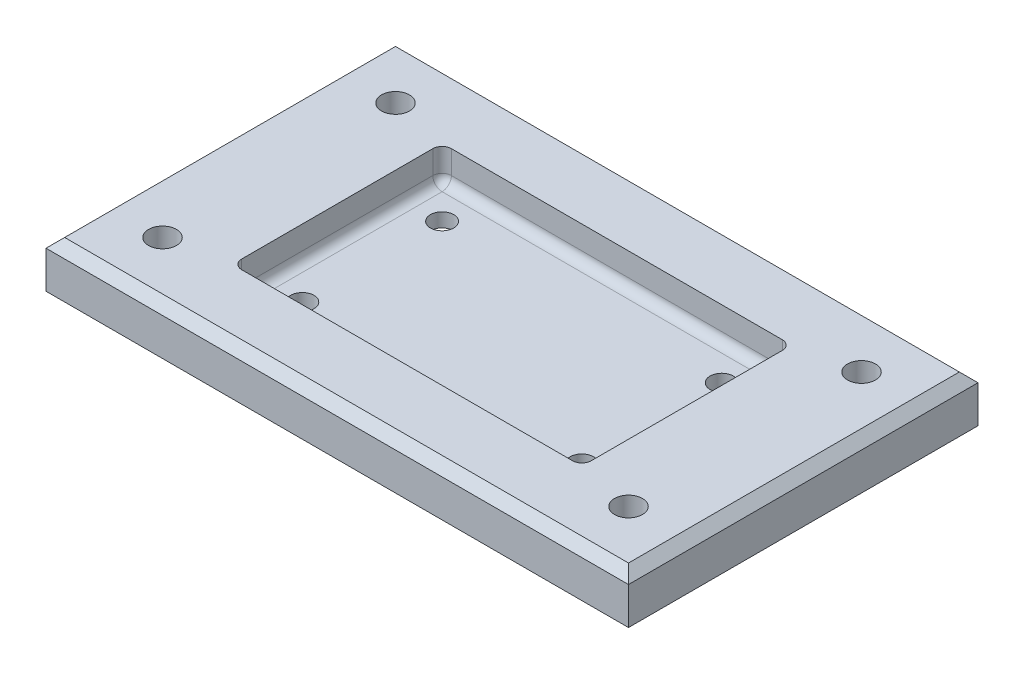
ISO-10303-21;
HEADER;
FILE_DESCRIPTION(('STEP AP214'),'2;1');
FILE_NAME('part.step','',(''),(''),'','','');
FILE_SCHEMA(('AUTOMOTIVE_DESIGN { 1 0 10303 214 1 1 1 1 }'));
ENDSEC;
DATA;
#1=APPLICATION_CONTEXT('core data for automotive mechanical design processes');
#2=APPLICATION_PROTOCOL_DEFINITION('international standard','automotive_design',2000,#1);
#3=PRODUCT_CONTEXT('',#1,'mechanical');
#4=PRODUCT('Part','Part','',(#3));
#5=PRODUCT_RELATED_PRODUCT_CATEGORY('part','',(#4));
#6=PRODUCT_DEFINITION_FORMATION('','',#4);
#7=PRODUCT_DEFINITION_CONTEXT('part definition',#1,'design');
#8=PRODUCT_DEFINITION('design','',#6,#7);
#9=PRODUCT_DEFINITION_SHAPE('','',#8);
#10=(LENGTH_UNIT() NAMED_UNIT(*) SI_UNIT(.MILLI.,.METRE.));
#11=(NAMED_UNIT(*) PLANE_ANGLE_UNIT() SI_UNIT($,.RADIAN.));
#12=(NAMED_UNIT(*) SI_UNIT($,.STERADIAN.) SOLID_ANGLE_UNIT());
#13=UNCERTAINTY_MEASURE_WITH_UNIT(LENGTH_MEASURE(1.E-05),#10,'distance_accuracy_value','');
#14=(GEOMETRIC_REPRESENTATION_CONTEXT(3) GLOBAL_UNCERTAINTY_ASSIGNED_CONTEXT((#13)) GLOBAL_UNIT_ASSIGNED_CONTEXT((#10,
#11,#12)) REPRESENTATION_CONTEXT('',''));
#15=CARTESIAN_POINT('',(0.,0.,0.));
#16=DIRECTION('',(0.,0.,1.));
#17=DIRECTION('',(1.,0.,0.));
#18=AXIS2_PLACEMENT_3D('',#15,#16,#17);
#19=CARTESIAN_POINT('',(62.5,10.,37.5));
#20=DIRECTION('',(-1.,0.,0.));
#21=DIRECTION('',(0.,0.,1.));
#22=AXIS2_PLACEMENT_3D('',#19,#20,#21);
#23=PLANE('',#22);
#24=DIRECTION('',(0.,-1.,0.));
#25=VECTOR('',#24,1.);
#26=CARTESIAN_POINT('',(62.5,10.,-37.5));
#27=LINE('',#26,#25);
#28=CARTESIAN_POINT('',(62.5,8.,-37.5));
#29=VERTEX_POINT('',#28);
#30=CARTESIAN_POINT('',(62.5,0.,-37.5));
#31=VERTEX_POINT('',#30);
#32=EDGE_CURVE('E221',#29,#31,#27,.T.);
#33=ORIENTED_EDGE('',*,*,#32,.F.);
#34=DIRECTION('',(0.,0.,1.));
#35=VECTOR('',#34,1.);
#36=CARTESIAN_POINT('',(62.5,8.,37.5));
#37=LINE('',#36,#35);
#38=CARTESIAN_POINT('',(62.5,8.,37.5));
#39=VERTEX_POINT('',#38);
#40=EDGE_CURVE('E321',#29,#39,#37,.T.);
#41=ORIENTED_EDGE('',*,*,#40,.T.);
#42=DIRECTION('',(0.,-1.,0.));
#43=VECTOR('',#42,1.);
#44=CARTESIAN_POINT('',(62.5,10.,37.5));
#45=LINE('',#44,#43);
#46=CARTESIAN_POINT('',(62.5,0.,37.5));
#47=VERTEX_POINT('',#46);
#48=EDGE_CURVE('E215',#39,#47,#45,.T.);
#49=ORIENTED_EDGE('',*,*,#48,.T.);
#50=DIRECTION('',(0.,0.,-1.));
#51=VECTOR('',#50,1.);
#52=CARTESIAN_POINT('',(62.5,0.,37.5));
#53=LINE('',#52,#51);
#54=EDGE_CURVE('E195',#47,#31,#53,.T.);
#55=ORIENTED_EDGE('',*,*,#54,.T.);
#56=EDGE_LOOP('',(#33,#41,#49,#55));
#57=FACE_BOUND('',#56,.T.);
#58=ADVANCED_FACE('F33',(#57),#23,.F.);
#59=CARTESIAN_POINT('',(-62.5,10.,-37.5));
#60=DIRECTION('',(0.,0.,1.));
#61=DIRECTION('',(1.,0.,0.));
#62=AXIS2_PLACEMENT_3D('',#59,#60,#61);
#63=PLANE('',#62);
#64=DIRECTION('',(0.,-1.,0.));
#65=VECTOR('',#64,1.);
#66=CARTESIAN_POINT('',(-62.5,10.,-37.5));
#67=LINE('',#66,#65);
#68=CARTESIAN_POINT('',(-62.5,8.,-37.5));
#69=VERTEX_POINT('',#68);
#70=CARTESIAN_POINT('',(-62.5,0.,-37.5));
#71=VERTEX_POINT('',#70);
#72=EDGE_CURVE('E219',#69,#71,#67,.T.);
#73=ORIENTED_EDGE('',*,*,#72,.F.);
#74=DIRECTION('',(1.,0.,0.));
#75=VECTOR('',#74,1.);
#76=CARTESIAN_POINT('',(-62.5,8.,-37.5));
#77=LINE('',#76,#75);
#78=EDGE_CURVE('E324',#69,#29,#77,.T.);
#79=ORIENTED_EDGE('',*,*,#78,.T.);
#80=ORIENTED_EDGE('',*,*,#32,.T.);
#81=DIRECTION('',(-1.,0.,0.));
#82=VECTOR('',#81,1.);
#83=CARTESIAN_POINT('',(-62.5,0.,-37.5));
#84=LINE('',#83,#82);
#85=EDGE_CURVE('E206',#31,#71,#84,.T.);
#86=ORIENTED_EDGE('',*,*,#85,.T.);
#87=EDGE_LOOP('',(#73,#79,#80,#86));
#88=FACE_BOUND('',#87,.T.);
#89=ADVANCED_FACE('F348',(#88),#63,.F.);
#90=CARTESIAN_POINT('',(-62.5,10.,37.5));
#91=DIRECTION('',(1.,0.,0.));
#92=DIRECTION('',(0.,0.,-1.));
#93=AXIS2_PLACEMENT_3D('',#90,#91,#92);
#94=PLANE('',#93);
#95=DIRECTION('',(0.,-1.,0.));
#96=VECTOR('',#95,1.);
#97=CARTESIAN_POINT('',(-62.5,10.,37.5));
#98=LINE('',#97,#96);
#99=CARTESIAN_POINT('',(-62.5,8.,37.5));
#100=VERTEX_POINT('',#99);
#101=CARTESIAN_POINT('',(-62.5,0.,37.5));
#102=VERTEX_POINT('',#101);
#103=EDGE_CURVE('E217',#100,#102,#98,.T.);
#104=ORIENTED_EDGE('',*,*,#103,.F.);
#105=DIRECTION('',(0.,0.,-1.));
#106=VECTOR('',#105,1.);
#107=CARTESIAN_POINT('',(-62.5,8.,37.5));
#108=LINE('',#107,#106);
#109=EDGE_CURVE('E42',#100,#69,#108,.T.);
#110=ORIENTED_EDGE('',*,*,#109,.T.);
#111=ORIENTED_EDGE('',*,*,#72,.T.);
#112=DIRECTION('',(0.,0.,1.));
#113=VECTOR('',#112,1.);
#114=CARTESIAN_POINT('',(-62.5,0.,37.5));
#115=LINE('',#114,#113);
#116=EDGE_CURVE('E209',#71,#102,#115,.T.);
#117=ORIENTED_EDGE('',*,*,#116,.T.);
#118=EDGE_LOOP('',(#104,#110,#111,#117));
#119=FACE_BOUND('',#118,.T.);
#120=ADVANCED_FACE('F445',(#119),#94,.F.);
#121=CARTESIAN_POINT('',(-62.5,10.,37.5));
#122=DIRECTION('',(0.,0.,-1.));
#123=DIRECTION('',(-1.,0.,0.));
#124=AXIS2_PLACEMENT_3D('',#121,#122,#123);
#125=PLANE('',#124);
#126=ORIENTED_EDGE('',*,*,#48,.F.);
#127=DIRECTION('',(-1.,0.,0.));
#128=VECTOR('',#127,1.);
#129=CARTESIAN_POINT('',(-62.5,8.,37.5));
#130=LINE('',#129,#128);
#131=EDGE_CURVE('E12',#39,#100,#130,.T.);
#132=ORIENTED_EDGE('',*,*,#131,.T.);
#133=ORIENTED_EDGE('',*,*,#103,.T.);
#134=DIRECTION('',(1.,0.,0.));
#135=VECTOR('',#134,1.);
#136=CARTESIAN_POINT('',(-62.5,0.,37.5));
#137=LINE('',#136,#135);
#138=EDGE_CURVE('E212',#102,#47,#137,.T.);
#139=ORIENTED_EDGE('',*,*,#138,.T.);
#140=EDGE_LOOP('',(#126,#132,#133,#139));
#141=FACE_BOUND('',#140,.T.);
#142=ADVANCED_FACE('F361',(#141),#125,.F.);
#143=CARTESIAN_POINT('',(62.5,10.,-37.5));
#144=DIRECTION('',(0.,-1.,0.));
#145=DIRECTION('',(0.,0.,-1.));
#146=AXIS2_PLACEMENT_3D('',#143,#144,#145);
#147=PLANE('',#146);
#148=DIRECTION('',(1.,0.,0.));
#149=VECTOR('',#148,1.);
#150=CARTESIAN_POINT('',(62.5,10.,35.5));
#151=LINE('',#150,#149);
#152=CARTESIAN_POINT('',(-60.5,10.,35.5));
#153=VERTEX_POINT('',#152);
#154=CARTESIAN_POINT('',(60.5,10.,35.5));
#155=VERTEX_POINT('',#154);
#156=EDGE_CURVE('E277',#153,#155,#151,.T.);
#157=ORIENTED_EDGE('',*,*,#156,.T.);
#158=DIRECTION('',(0.,0.,-1.));
#159=VECTOR('',#158,1.);
#160=CARTESIAN_POINT('',(60.5,10.,-37.5));
#161=LINE('',#160,#159);
#162=CARTESIAN_POINT('',(60.5,10.,-35.5));
#163=VERTEX_POINT('',#162);
#164=EDGE_CURVE('E318',#155,#163,#161,.T.);
#165=ORIENTED_EDGE('',*,*,#164,.T.);
#166=DIRECTION('',(-1.,0.,0.));
#167=VECTOR('',#166,1.);
#168=CARTESIAN_POINT('',(62.5,10.,-35.5));
#169=LINE('',#168,#167);
#170=CARTESIAN_POINT('',(-60.5,10.,-35.5));
#171=VERTEX_POINT('',#170);
#172=EDGE_CURVE('E316',#163,#171,#169,.T.);
#173=ORIENTED_EDGE('',*,*,#172,.T.);
#174=DIRECTION('',(0.,0.,1.));
#175=VECTOR('',#174,1.);
#176=CARTESIAN_POINT('',(-60.5,10.,-37.5));
#177=LINE('',#176,#175);
#178=EDGE_CURVE('E314',#171,#153,#177,.T.);
#179=ORIENTED_EDGE('',*,*,#178,.T.);
#180=EDGE_LOOP('',(#157,#165,#173,#179));
#181=FACE_BOUND('',#180,.T.);
#182=CARTESIAN_POINT('',(-50.,10.,-25.));
#183=DIRECTION('',(0.,1.,0.));
#184=DIRECTION('',(0.,0.,1.));
#185=AXIS2_PLACEMENT_3D('',#182,#183,#184);
#186=CIRCLE('',#185,2.99999999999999);
#187=CARTESIAN_POINT('',(-50.,10.,-22.));
#188=VERTEX_POINT('',#187);
#189=EDGE_CURVE('E167',#188,#188,#186,.T.);
#190=ORIENTED_EDGE('',*,*,#189,.F.);
#191=EDGE_LOOP('',(#190));
#192=FACE_BOUND('',#191,.T.);
#193=CARTESIAN_POINT('',(-50.,10.,25.));
#194=DIRECTION('',(0.,1.,0.));
#195=DIRECTION('',(0.,0.,1.));
#196=AXIS2_PLACEMENT_3D('',#193,#194,#195);
#197=CIRCLE('',#196,2.99999999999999);
#198=CARTESIAN_POINT('',(-50.,10.,28.));
#199=VERTEX_POINT('',#198);
#200=EDGE_CURVE('E166',#199,#199,#197,.T.);
#201=ORIENTED_EDGE('',*,*,#200,.F.);
#202=EDGE_LOOP('',(#201));
#203=FACE_BOUND('',#202,.T.);
#204=CARTESIAN_POINT('',(50.,10.,-25.));
#205=DIRECTION('',(0.,1.,0.));
#206=DIRECTION('',(0.,0.,1.));
#207=AXIS2_PLACEMENT_3D('',#204,#205,#206);
#208=CIRCLE('',#207,2.99999999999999);
#209=CARTESIAN_POINT('',(50.,10.,-22.));
#210=VERTEX_POINT('',#209);
#211=EDGE_CURVE('E179',#210,#210,#208,.T.);
#212=ORIENTED_EDGE('',*,*,#211,.F.);
#213=EDGE_LOOP('',(#212));
#214=FACE_BOUND('',#213,.T.);
#215=CARTESIAN_POINT('',(50.,10.,25.));
#216=DIRECTION('',(0.,1.,0.));
#217=DIRECTION('',(0.,0.,1.));
#218=AXIS2_PLACEMENT_3D('',#215,#216,#217);
#219=CIRCLE('',#218,2.99999999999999);
#220=CARTESIAN_POINT('',(50.,10.,28.));
#221=VERTEX_POINT('',#220);
#222=EDGE_CURVE('E185',#221,#221,#219,.T.);
#223=ORIENTED_EDGE('',*,*,#222,.F.);
#224=EDGE_LOOP('',(#223));
#225=FACE_BOUND('',#224,.T.);
#226=DIRECTION('',(0.,0.,1.));
#227=VECTOR('',#226,1.);
#228=CARTESIAN_POINT('',(-37.5,10.,22.5));
#229=LINE('',#228,#227);
#230=CARTESIAN_POINT('',(-37.5,10.,-20.5));
#231=VERTEX_POINT('',#230);
#232=CARTESIAN_POINT('',(-37.5,10.,20.5));
#233=VERTEX_POINT('',#232);
#234=EDGE_CURVE('E196',#231,#233,#229,.T.);
#235=ORIENTED_EDGE('',*,*,#234,.F.);
#236=CARTESIAN_POINT('',(-35.5,9.99999999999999,-20.5));
#237=DIRECTION('',(0.,-1.,0.));
#238=DIRECTION('',(0.,0.,-1.));
#239=AXIS2_PLACEMENT_3D('',#236,#237,#238);
#240=CIRCLE('',#239,2.);
#241=CARTESIAN_POINT('',(-35.5,10.,-22.5));
#242=VERTEX_POINT('',#241);
#243=EDGE_CURVE('E275',#231,#242,#240,.T.);
#244=ORIENTED_EDGE('',*,*,#243,.T.);
#245=DIRECTION('',(-1.,0.,0.));
#246=VECTOR('',#245,1.);
#247=CARTESIAN_POINT('',(-37.5,10.,-22.5));
#248=LINE('',#247,#246);
#249=CARTESIAN_POINT('',(35.5,10.,-22.5));
#250=VERTEX_POINT('',#249);
#251=EDGE_CURVE('E199',#250,#242,#248,.T.);
#252=ORIENTED_EDGE('',*,*,#251,.F.);
#253=CARTESIAN_POINT('',(35.5,9.99999999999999,-20.5));
#254=DIRECTION('',(0.,-1.,0.));
#255=DIRECTION('',(0.,0.,-1.));
#256=AXIS2_PLACEMENT_3D('',#253,#254,#255);
#257=CIRCLE('',#256,2.);
#258=CARTESIAN_POINT('',(37.5,10.,-20.5));
#259=VERTEX_POINT('',#258);
#260=EDGE_CURVE('E273',#250,#259,#257,.T.);
#261=ORIENTED_EDGE('',*,*,#260,.T.);
#262=DIRECTION('',(0.,0.,-1.));
#263=VECTOR('',#262,1.);
#264=CARTESIAN_POINT('',(37.5,10.,22.5));
#265=LINE('',#264,#263);
#266=CARTESIAN_POINT('',(37.5,10.,20.5));
#267=VERTEX_POINT('',#266);
#268=EDGE_CURVE('E191',#267,#259,#265,.T.);
#269=ORIENTED_EDGE('',*,*,#268,.F.);
#270=CARTESIAN_POINT('',(35.5,9.99999999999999,20.5));
#271=DIRECTION('',(0.,-1.,0.));
#272=DIRECTION('',(0.,0.,-1.));
#273=AXIS2_PLACEMENT_3D('',#270,#271,#272);
#274=CIRCLE('',#273,2.);
#275=CARTESIAN_POINT('',(35.5,10.,22.5));
#276=VERTEX_POINT('',#275);
#277=EDGE_CURVE('E271',#267,#276,#274,.T.);
#278=ORIENTED_EDGE('',*,*,#277,.T.);
#279=DIRECTION('',(1.,0.,0.));
#280=VECTOR('',#279,1.);
#281=CARTESIAN_POINT('',(-37.5,10.,22.5));
#282=LINE('',#281,#280);
#283=CARTESIAN_POINT('',(-35.5,10.,22.5));
#284=VERTEX_POINT('',#283);
#285=EDGE_CURVE('E192',#284,#276,#282,.T.);
#286=ORIENTED_EDGE('',*,*,#285,.F.);
#287=CARTESIAN_POINT('',(-35.5,9.99999999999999,20.5));
#288=DIRECTION('',(0.,-1.,0.));
#289=DIRECTION('',(0.,0.,-1.));
#290=AXIS2_PLACEMENT_3D('',#287,#288,#289);
#291=CIRCLE('',#290,2.);
#292=EDGE_CURVE('E269',#284,#233,#291,.T.);
#293=ORIENTED_EDGE('',*,*,#292,.T.);
#294=EDGE_LOOP('',(#235,#244,#252,#261,#269,#278,#286,#293));
#295=FACE_BOUND('',#294,.T.);
#296=ADVANCED_FACE('F357',(#181,#192,#203,#214,#225,#295),#147,.F.);
#297=CARTESIAN_POINT('',(62.5,0.,-37.5));
#298=DIRECTION('',(0.,-1.,0.));
#299=DIRECTION('',(0.,0.,-1.));
#300=AXIS2_PLACEMENT_3D('',#297,#298,#299);
#301=PLANE('',#300);
#302=CARTESIAN_POINT('',(-30.,0.,-15.));
#303=DIRECTION('',(0.,1.,0.));
#304=DIRECTION('',(0.,0.,1.));
#305=AXIS2_PLACEMENT_3D('',#302,#303,#304);
#306=CIRCLE('',#305,2.5);
#307=CARTESIAN_POINT('',(-30.,0.,-12.5));
#308=VERTEX_POINT('',#307);
#309=EDGE_CURVE('E312',#308,#308,#306,.T.);
#310=ORIENTED_EDGE('',*,*,#309,.T.);
#311=EDGE_LOOP('',(#310));
#312=FACE_BOUND('',#311,.T.);
#313=CARTESIAN_POINT('',(-30.,0.,15.));
#314=DIRECTION('',(0.,1.,0.));
#315=DIRECTION('',(0.,0.,1.));
#316=AXIS2_PLACEMENT_3D('',#313,#314,#315);
#317=CIRCLE('',#316,2.5);
#318=CARTESIAN_POINT('',(-30.,0.,17.5));
#319=VERTEX_POINT('',#318);
#320=EDGE_CURVE('E173',#319,#319,#317,.T.);
#321=ORIENTED_EDGE('',*,*,#320,.T.);
#322=EDGE_LOOP('',(#321));
#323=FACE_BOUND('',#322,.T.);
#324=ORIENTED_EDGE('',*,*,#54,.F.);
#325=ORIENTED_EDGE('',*,*,#138,.F.);
#326=ORIENTED_EDGE('',*,*,#116,.F.);
#327=ORIENTED_EDGE('',*,*,#85,.F.);
#328=EDGE_LOOP('',(#324,#325,#326,#327));
#329=FACE_BOUND('',#328,.T.);
#330=CARTESIAN_POINT('',(30.,0.,15.));
#331=DIRECTION('',(0.,1.,0.));
#332=DIRECTION('',(0.,0.,1.));
#333=AXIS2_PLACEMENT_3D('',#330,#331,#332);
#334=CIRCLE('',#333,2.5);
#335=CARTESIAN_POINT('',(30.,0.,17.5));
#336=VERTEX_POINT('',#335);
#337=EDGE_CURVE('E223',#336,#336,#334,.T.);
#338=ORIENTED_EDGE('',*,*,#337,.T.);
#339=EDGE_LOOP('',(#338));
#340=FACE_BOUND('',#339,.T.);
#341=CARTESIAN_POINT('',(30.,0.,-15.));
#342=DIRECTION('',(0.,1.,0.));
#343=DIRECTION('',(0.,0.,1.));
#344=AXIS2_PLACEMENT_3D('',#341,#342,#343);
#345=CIRCLE('',#344,2.5);
#346=CARTESIAN_POINT('',(30.,0.,-12.5));
#347=VERTEX_POINT('',#346);
#348=EDGE_CURVE('E229',#347,#347,#345,.T.);
#349=ORIENTED_EDGE('',*,*,#348,.T.);
#350=EDGE_LOOP('',(#349));
#351=FACE_BOUND('',#350,.T.);
#352=ADVANCED_FACE('F360',(#312,#323,#329,#340,#351),#301,.T.);
#353=CARTESIAN_POINT('',(62.5,3.,-37.5));
#354=DIRECTION('',(0.,-1.,0.));
#355=DIRECTION('',(0.,0.,-1.));
#356=AXIS2_PLACEMENT_3D('',#353,#354,#355);
#357=PLANE('',#356);
#358=DIRECTION('',(0.,0.,-1.));
#359=VECTOR('',#358,1.);
#360=CARTESIAN_POINT('',(35.5,3.,-22.5));
#361=LINE('',#360,#359);
#362=CARTESIAN_POINT('',(35.5,3.,20.5));
#363=VERTEX_POINT('',#362);
#364=CARTESIAN_POINT('',(35.5,3.,-20.5));
#365=VERTEX_POINT('',#364);
#366=EDGE_CURVE('E235',#363,#365,#361,.T.);
#367=ORIENTED_EDGE('',*,*,#366,.T.);
#368=DIRECTION('',(-1.,0.,0.));
#369=VECTOR('',#368,1.);
#370=CARTESIAN_POINT('',(-37.5,3.,-20.5));
#371=LINE('',#370,#369);
#372=CARTESIAN_POINT('',(-35.5,3.,-20.5));
#373=VERTEX_POINT('',#372);
#374=EDGE_CURVE('E241',#365,#373,#371,.T.);
#375=ORIENTED_EDGE('',*,*,#374,.T.);
#376=DIRECTION('',(0.,0.,1.));
#377=VECTOR('',#376,1.);
#378=CARTESIAN_POINT('',(-35.5,3.,22.5));
#379=LINE('',#378,#377);
#380=CARTESIAN_POINT('',(-35.5,3.,20.5));
#381=VERTEX_POINT('',#380);
#382=EDGE_CURVE('E239',#373,#381,#379,.T.);
#383=ORIENTED_EDGE('',*,*,#382,.T.);
#384=DIRECTION('',(1.,0.,0.));
#385=VECTOR('',#384,1.);
#386=CARTESIAN_POINT('',(37.5,3.,20.5));
#387=LINE('',#386,#385);
#388=EDGE_CURVE('E237',#381,#363,#387,.T.);
#389=ORIENTED_EDGE('',*,*,#388,.T.);
#390=EDGE_LOOP('',(#367,#375,#383,#389));
#391=FACE_BOUND('',#390,.T.);
#392=CARTESIAN_POINT('',(-30.,3.,-15.));
#393=DIRECTION('',(0.,1.,0.));
#394=DIRECTION('',(0.,0.,1.));
#395=AXIS2_PLACEMENT_3D('',#392,#393,#394);
#396=CIRCLE('',#395,2.5);
#397=CARTESIAN_POINT('',(-30.,3.,-12.5));
#398=VERTEX_POINT('',#397);
#399=EDGE_CURVE('E719',#398,#398,#396,.T.);
#400=ORIENTED_EDGE('',*,*,#399,.F.);
#401=EDGE_LOOP('',(#400));
#402=FACE_BOUND('',#401,.T.);
#403=CARTESIAN_POINT('',(-30.,3.,15.));
#404=DIRECTION('',(0.,1.,0.));
#405=DIRECTION('',(0.,0.,1.));
#406=AXIS2_PLACEMENT_3D('',#403,#404,#405);
#407=CIRCLE('',#406,2.5);
#408=CARTESIAN_POINT('',(-30.,3.,17.5));
#409=VERTEX_POINT('',#408);
#410=EDGE_CURVE('E716',#409,#409,#407,.T.);
#411=ORIENTED_EDGE('',*,*,#410,.F.);
#412=EDGE_LOOP('',(#411));
#413=FACE_BOUND('',#412,.T.);
#414=CARTESIAN_POINT('',(30.,3.,15.));
#415=DIRECTION('',(0.,1.,0.));
#416=DIRECTION('',(0.,0.,1.));
#417=AXIS2_PLACEMENT_3D('',#414,#415,#416);
#418=CIRCLE('',#417,2.5);
#419=CARTESIAN_POINT('',(30.,3.,17.5));
#420=VERTEX_POINT('',#419);
#421=EDGE_CURVE('E226',#420,#420,#418,.T.);
#422=ORIENTED_EDGE('',*,*,#421,.F.);
#423=EDGE_LOOP('',(#422));
#424=FACE_BOUND('',#423,.T.);
#425=CARTESIAN_POINT('',(30.,3.,-15.));
#426=DIRECTION('',(0.,1.,0.));
#427=DIRECTION('',(0.,0.,1.));
#428=AXIS2_PLACEMENT_3D('',#425,#426,#427);
#429=CIRCLE('',#428,2.5);
#430=CARTESIAN_POINT('',(30.,3.,-12.5));
#431=VERTEX_POINT('',#430);
#432=EDGE_CURVE('E232',#431,#431,#429,.T.);
#433=ORIENTED_EDGE('',*,*,#432,.F.);
#434=EDGE_LOOP('',(#433));
#435=FACE_BOUND('',#434,.T.);
#436=ADVANCED_FACE('F438',(#391,#402,#413,#424,#435),#357,.F.);
#437=CARTESIAN_POINT('',(-37.5,-87.4642784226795,-22.5));
#438=DIRECTION('',(0.,0.,-1.));
#439=DIRECTION('',(-1.,0.,0.));
#440=AXIS2_PLACEMENT_3D('',#437,#438,#439);
#441=PLANE('',#440);
#442=DIRECTION('',(-1.,0.,0.));
#443=VECTOR('',#442,1.);
#444=CARTESIAN_POINT('',(37.5,5.,-22.5));
#445=LINE('',#444,#443);
#446=CARTESIAN_POINT('',(-35.5,5.,-22.5));
#447=VERTEX_POINT('',#446);
#448=CARTESIAN_POINT('',(35.5,5.,-22.5));
#449=VERTEX_POINT('',#448);
#450=EDGE_CURVE('E246',#447,#449,#445,.F.);
#451=ORIENTED_EDGE('',*,*,#450,.T.);
#452=DIRECTION('',(0.,1.,0.));
#453=VECTOR('',#452,1.);
#454=CARTESIAN_POINT('',(35.5,9.99999999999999,-22.5));
#455=LINE('',#454,#453);
#456=EDGE_CURVE('E249',#449,#250,#455,.T.);
#457=ORIENTED_EDGE('',*,*,#456,.T.);
#458=ORIENTED_EDGE('',*,*,#251,.T.);
#459=DIRECTION('',(0.,1.,0.));
#460=VECTOR('',#459,1.);
#461=CARTESIAN_POINT('',(-35.5,3.,-22.5));
#462=LINE('',#461,#460);
#463=EDGE_CURVE('E244',#242,#447,#462,.F.);
#464=ORIENTED_EDGE('',*,*,#463,.T.);
#465=EDGE_LOOP('',(#451,#457,#458,#464));
#466=FACE_BOUND('',#465,.T.);
#467=ADVANCED_FACE('F386',(#466),#441,.F.);
#468=CARTESIAN_POINT('',(-37.5,-87.4642784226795,22.5));
#469=DIRECTION('',(-1.,0.,0.));
#470=DIRECTION('',(0.,0.,1.));
#471=AXIS2_PLACEMENT_3D('',#468,#469,#470);
#472=PLANE('',#471);
#473=ORIENTED_EDGE('',*,*,#234,.T.);
#474=DIRECTION('',(0.,1.,0.));
#475=VECTOR('',#474,1.);
#476=CARTESIAN_POINT('',(-37.5,3.,20.5));
#477=LINE('',#476,#475);
#478=CARTESIAN_POINT('',(-37.5,5.,20.5));
#479=VERTEX_POINT('',#478);
#480=EDGE_CURVE('E255',#233,#479,#477,.F.);
#481=ORIENTED_EDGE('',*,*,#480,.T.);
#482=DIRECTION('',(0.,0.,1.));
#483=VECTOR('',#482,1.);
#484=CARTESIAN_POINT('',(-37.5,5.,-22.5));
#485=LINE('',#484,#483);
#486=CARTESIAN_POINT('',(-37.5,5.,-20.5));
#487=VERTEX_POINT('',#486);
#488=EDGE_CURVE('E253',#479,#487,#485,.F.);
#489=ORIENTED_EDGE('',*,*,#488,.T.);
#490=DIRECTION('',(0.,1.,0.));
#491=VECTOR('',#490,1.);
#492=CARTESIAN_POINT('',(-37.5,9.99999999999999,-20.5));
#493=LINE('',#492,#491);
#494=EDGE_CURVE('E251',#487,#231,#493,.T.);
#495=ORIENTED_EDGE('',*,*,#494,.T.);
#496=EDGE_LOOP('',(#473,#481,#489,#495));
#497=FACE_BOUND('',#496,.T.);
#498=ADVANCED_FACE('F430',(#497),#472,.F.);
#499=CARTESIAN_POINT('',(-37.5,-87.4642784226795,22.5));
#500=DIRECTION('',(0.,0.,1.));
#501=DIRECTION('',(1.,0.,0.));
#502=AXIS2_PLACEMENT_3D('',#499,#500,#501);
#503=PLANE('',#502);
#504=DIRECTION('',(1.,0.,0.));
#505=VECTOR('',#504,1.);
#506=CARTESIAN_POINT('',(-37.5,5.,22.5));
#507=LINE('',#506,#505);
#508=CARTESIAN_POINT('',(35.5,5.,22.5));
#509=VERTEX_POINT('',#508);
#510=CARTESIAN_POINT('',(-35.5,5.,22.5));
#511=VERTEX_POINT('',#510);
#512=EDGE_CURVE('E259',#509,#511,#507,.F.);
#513=ORIENTED_EDGE('',*,*,#512,.T.);
#514=DIRECTION('',(0.,1.,0.));
#515=VECTOR('',#514,1.);
#516=CARTESIAN_POINT('',(-35.5,9.99999999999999,22.5));
#517=LINE('',#516,#515);
#518=EDGE_CURVE('E261',#511,#284,#517,.T.);
#519=ORIENTED_EDGE('',*,*,#518,.T.);
#520=ORIENTED_EDGE('',*,*,#285,.T.);
#521=DIRECTION('',(0.,1.,0.));
#522=VECTOR('',#521,1.);
#523=CARTESIAN_POINT('',(35.5,3.,22.5));
#524=LINE('',#523,#522);
#525=EDGE_CURVE('E257',#276,#509,#524,.F.);
#526=ORIENTED_EDGE('',*,*,#525,.T.);
#527=EDGE_LOOP('',(#513,#519,#520,#526));
#528=FACE_BOUND('',#527,.T.);
#529=ADVANCED_FACE('F413',(#528),#503,.F.);
#530=CARTESIAN_POINT('',(37.5,-87.4642784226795,22.5));
#531=DIRECTION('',(1.,0.,0.));
#532=DIRECTION('',(0.,0.,-1.));
#533=AXIS2_PLACEMENT_3D('',#530,#531,#532);
#534=PLANE('',#533);
#535=DIRECTION('',(0.,0.,-1.));
#536=VECTOR('',#535,1.);
#537=CARTESIAN_POINT('',(37.5,5.,22.5));
#538=LINE('',#537,#536);
#539=CARTESIAN_POINT('',(37.5,5.,-20.5));
#540=VERTEX_POINT('',#539);
#541=CARTESIAN_POINT('',(37.5,5.,20.5));
#542=VERTEX_POINT('',#541);
#543=EDGE_CURVE('E265',#540,#542,#538,.F.);
#544=ORIENTED_EDGE('',*,*,#543,.T.);
#545=DIRECTION('',(0.,1.,0.));
#546=VECTOR('',#545,1.);
#547=CARTESIAN_POINT('',(37.5,9.99999999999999,20.5));
#548=LINE('',#547,#546);
#549=EDGE_CURVE('E267',#542,#267,#548,.T.);
#550=ORIENTED_EDGE('',*,*,#549,.T.);
#551=ORIENTED_EDGE('',*,*,#268,.T.);
#552=DIRECTION('',(0.,1.,0.));
#553=VECTOR('',#552,1.);
#554=CARTESIAN_POINT('',(37.5,3.,-20.5));
#555=LINE('',#554,#553);
#556=EDGE_CURVE('E263',#259,#540,#555,.F.);
#557=ORIENTED_EDGE('',*,*,#556,.T.);
#558=EDGE_LOOP('',(#544,#550,#551,#557));
#559=FACE_BOUND('',#558,.T.);
#560=ADVANCED_FACE('F396',(#559),#534,.F.);
#561=CARTESIAN_POINT('',(50.,2.99999999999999,25.));
#562=DIRECTION('',(0.,1.,0.));
#563=DIRECTION('',(0.,0.,1.));
#564=AXIS2_PLACEMENT_3D('',#561,#562,#563);
#565=CONICAL_SURFACE('',#564,2.99999999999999,1.0471975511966);
#566=CARTESIAN_POINT('',(50.,1.26794919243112,25.));
#567=VERTEX_POINT('',#566);
#568=VERTEX_LOOP('',#567);
#569=FACE_BOUND('',#568,.T.);
#570=CARTESIAN_POINT('',(50.,2.99999999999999,25.));
#571=DIRECTION('',(0.,1.,0.));
#572=DIRECTION('',(0.,0.,1.));
#573=AXIS2_PLACEMENT_3D('',#570,#571,#572);
#574=CIRCLE('',#573,2.99999999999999);
#575=CARTESIAN_POINT('',(50.,2.99999999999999,28.));
#576=VERTEX_POINT('',#575);
#577=EDGE_CURVE('E188',#576,#576,#574,.T.);
#578=ORIENTED_EDGE('',*,*,#577,.T.);
#579=EDGE_LOOP('',(#578));
#580=FACE_BOUND('',#579,.T.);
#581=ADVANCED_FACE('F620',(#569,#580),#565,.F.);
#582=CARTESIAN_POINT('',(50.,10.,25.));
#583=DIRECTION('',(0.,1.,0.));
#584=DIRECTION('',(0.,0.,1.));
#585=AXIS2_PLACEMENT_3D('',#582,#583,#584);
#586=CYLINDRICAL_SURFACE('',#585,2.99999999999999);
#587=ORIENTED_EDGE('',*,*,#577,.F.);
#588=EDGE_LOOP('',(#587));
#589=FACE_BOUND('',#588,.T.);
#590=ORIENTED_EDGE('',*,*,#222,.T.);
#591=EDGE_LOOP('',(#590));
#592=FACE_BOUND('',#591,.T.);
#593=ADVANCED_FACE('F612',(#589,#592),#586,.F.);
#594=CARTESIAN_POINT('',(50.,2.99999999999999,-25.));
#595=DIRECTION('',(0.,1.,0.));
#596=DIRECTION('',(0.,0.,1.));
#597=AXIS2_PLACEMENT_3D('',#594,#595,#596);
#598=CONICAL_SURFACE('',#597,2.99999999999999,1.0471975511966);
#599=CARTESIAN_POINT('',(50.,1.26794919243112,-25.));
#600=VERTEX_POINT('',#599);
#601=VERTEX_LOOP('',#600);
#602=FACE_BOUND('',#601,.T.);
#603=CARTESIAN_POINT('',(50.,2.99999999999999,-25.));
#604=DIRECTION('',(0.,1.,0.));
#605=DIRECTION('',(0.,0.,1.));
#606=AXIS2_PLACEMENT_3D('',#603,#604,#605);
#607=CIRCLE('',#606,2.99999999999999);
#608=CARTESIAN_POINT('',(50.,2.99999999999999,-22.));
#609=VERTEX_POINT('',#608);
#610=EDGE_CURVE('E182',#609,#609,#607,.T.);
#611=ORIENTED_EDGE('',*,*,#610,.T.);
#612=EDGE_LOOP('',(#611));
#613=FACE_BOUND('',#612,.T.);
#614=ADVANCED_FACE('F604',(#602,#613),#598,.F.);
#615=CARTESIAN_POINT('',(50.,10.,-25.));
#616=DIRECTION('',(0.,1.,0.));
#617=DIRECTION('',(0.,0.,1.));
#618=AXIS2_PLACEMENT_3D('',#615,#616,#617);
#619=CYLINDRICAL_SURFACE('',#618,2.99999999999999);
#620=ORIENTED_EDGE('',*,*,#610,.F.);
#621=EDGE_LOOP('',(#620));
#622=FACE_BOUND('',#621,.T.);
#623=ORIENTED_EDGE('',*,*,#211,.T.);
#624=EDGE_LOOP('',(#623));
#625=FACE_BOUND('',#624,.T.);
#626=ADVANCED_FACE('F596',(#622,#625),#619,.F.);
#627=CARTESIAN_POINT('',(-50.,2.99999999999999,25.));
#628=DIRECTION('',(0.,1.,0.));
#629=DIRECTION('',(0.,0.,1.));
#630=AXIS2_PLACEMENT_3D('',#627,#628,#629);
#631=CONICAL_SURFACE('',#630,2.99999999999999,1.0471975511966);
#632=CARTESIAN_POINT('',(-50.,1.26794919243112,25.));
#633=VERTEX_POINT('',#632);
#634=VERTEX_LOOP('',#633);
#635=FACE_BOUND('',#634,.T.);
#636=CARTESIAN_POINT('',(-50.,2.99999999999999,25.));
#637=DIRECTION('',(0.,1.,0.));
#638=DIRECTION('',(0.,0.,1.));
#639=AXIS2_PLACEMENT_3D('',#636,#637,#638);
#640=CIRCLE('',#639,2.99999999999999);
#641=CARTESIAN_POINT('',(-50.,2.99999999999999,28.));
#642=VERTEX_POINT('',#641);
#643=EDGE_CURVE('E170',#642,#642,#640,.T.);
#644=ORIENTED_EDGE('',*,*,#643,.T.);
#645=EDGE_LOOP('',(#644));
#646=FACE_BOUND('',#645,.T.);
#647=ADVANCED_FACE('F588',(#635,#646),#631,.F.);
#648=CARTESIAN_POINT('',(-50.,10.,25.));
#649=DIRECTION('',(0.,1.,0.));
#650=DIRECTION('',(0.,0.,1.));
#651=AXIS2_PLACEMENT_3D('',#648,#649,#650);
#652=CYLINDRICAL_SURFACE('',#651,2.99999999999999);
#653=ORIENTED_EDGE('',*,*,#643,.F.);
#654=EDGE_LOOP('',(#653));
#655=FACE_BOUND('',#654,.T.);
#656=ORIENTED_EDGE('',*,*,#200,.T.);
#657=EDGE_LOOP('',(#656));
#658=FACE_BOUND('',#657,.T.);
#659=ADVANCED_FACE('F160',(#655,#658),#652,.F.);
#660=CARTESIAN_POINT('',(-50.,2.99999999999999,-25.));
#661=DIRECTION('',(0.,1.,0.));
#662=DIRECTION('',(0.,0.,1.));
#663=AXIS2_PLACEMENT_3D('',#660,#661,#662);
#664=CONICAL_SURFACE('',#663,2.99999999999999,1.0471975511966);
#665=CARTESIAN_POINT('',(-50.,1.26794919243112,-25.));
#666=VERTEX_POINT('',#665);
#667=VERTEX_LOOP('',#666);
#668=FACE_BOUND('',#667,.T.);
#669=CARTESIAN_POINT('',(-50.,2.99999999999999,-25.));
#670=DIRECTION('',(0.,1.,0.));
#671=DIRECTION('',(0.,0.,1.));
#672=AXIS2_PLACEMENT_3D('',#669,#670,#671);
#673=CIRCLE('',#672,2.99999999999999);
#674=CARTESIAN_POINT('',(-50.,2.99999999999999,-22.));
#675=VERTEX_POINT('',#674);
#676=EDGE_CURVE('E164',#675,#675,#673,.T.);
#677=ORIENTED_EDGE('',*,*,#676,.T.);
#678=EDGE_LOOP('',(#677));
#679=FACE_BOUND('',#678,.T.);
#680=ADVANCED_FACE('F156',(#668,#679),#664,.F.);
#681=CARTESIAN_POINT('',(-50.,10.,-25.));
#682=DIRECTION('',(0.,1.,0.));
#683=DIRECTION('',(0.,0.,1.));
#684=AXIS2_PLACEMENT_3D('',#681,#682,#683);
#685=CYLINDRICAL_SURFACE('',#684,2.99999999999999);
#686=ORIENTED_EDGE('',*,*,#676,.F.);
#687=EDGE_LOOP('',(#686));
#688=FACE_BOUND('',#687,.T.);
#689=ORIENTED_EDGE('',*,*,#189,.T.);
#690=EDGE_LOOP('',(#689));
#691=FACE_BOUND('',#690,.T.);
#692=ADVANCED_FACE('F159',(#688,#691),#685,.F.);
#693=CARTESIAN_POINT('',(-30.,0.,15.));
#694=DIRECTION('',(0.,1.,0.));
#695=DIRECTION('',(0.,0.,1.));
#696=AXIS2_PLACEMENT_3D('',#693,#694,#695);
#697=CYLINDRICAL_SURFACE('',#696,2.5);
#698=ORIENTED_EDGE('',*,*,#320,.F.);
#699=EDGE_LOOP('',(#698));
#700=FACE_BOUND('',#699,.T.);
#701=ORIENTED_EDGE('',*,*,#410,.T.);
#702=EDGE_LOOP('',(#701));
#703=FACE_BOUND('',#702,.T.);
#704=ADVANCED_FACE('F562',(#700,#703),#697,.F.);
#705=CARTESIAN_POINT('',(-30.,0.,-15.));
#706=DIRECTION('',(0.,1.,0.));
#707=DIRECTION('',(0.,0.,1.));
#708=AXIS2_PLACEMENT_3D('',#705,#706,#707);
#709=CYLINDRICAL_SURFACE('',#708,2.5);
#710=ORIENTED_EDGE('',*,*,#309,.F.);
#711=EDGE_LOOP('',(#710));
#712=FACE_BOUND('',#711,.T.);
#713=ORIENTED_EDGE('',*,*,#399,.T.);
#714=EDGE_LOOP('',(#713));
#715=FACE_BOUND('',#714,.T.);
#716=ADVANCED_FACE('F453',(#712,#715),#709,.F.);
#717=CARTESIAN_POINT('',(30.,0.,15.));
#718=DIRECTION('',(0.,1.,0.));
#719=DIRECTION('',(0.,0.,1.));
#720=AXIS2_PLACEMENT_3D('',#717,#718,#719);
#721=CYLINDRICAL_SURFACE('',#720,2.5);
#722=ORIENTED_EDGE('',*,*,#337,.F.);
#723=EDGE_LOOP('',(#722));
#724=FACE_BOUND('',#723,.T.);
#725=ORIENTED_EDGE('',*,*,#421,.T.);
#726=EDGE_LOOP('',(#725));
#727=FACE_BOUND('',#726,.T.);
#728=ADVANCED_FACE('F449',(#724,#727),#721,.F.);
#729=CARTESIAN_POINT('',(30.,0.,-15.));
#730=DIRECTION('',(0.,1.,0.));
#731=DIRECTION('',(0.,0.,1.));
#732=AXIS2_PLACEMENT_3D('',#729,#730,#731);
#733=CYLINDRICAL_SURFACE('',#732,2.5);
#734=ORIENTED_EDGE('',*,*,#348,.F.);
#735=EDGE_LOOP('',(#734));
#736=FACE_BOUND('',#735,.T.);
#737=ORIENTED_EDGE('',*,*,#432,.T.);
#738=EDGE_LOOP('',(#737));
#739=FACE_BOUND('',#738,.T.);
#740=ADVANCED_FACE('F452',(#736,#739),#733,.F.);
#741=CARTESIAN_POINT('',(35.5,-87.4642784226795,20.5));
#742=DIRECTION('',(0.,-1.,0.));
#743=DIRECTION('',(0.,0.,-1.));
#744=AXIS2_PLACEMENT_3D('',#741,#742,#743);
#745=CYLINDRICAL_SURFACE('',#744,2.);
#746=ORIENTED_EDGE('',*,*,#277,.F.);
#747=ORIENTED_EDGE('',*,*,#549,.F.);
#748=CARTESIAN_POINT('',(35.5,5.,20.5));
#749=DIRECTION('',(0.,1.,0.));
#750=DIRECTION('',(0.,0.,1.));
#751=AXIS2_PLACEMENT_3D('',#748,#749,#750);
#752=CIRCLE('',#751,2.);
#753=EDGE_CURVE('E309',#509,#542,#752,.T.);
#754=ORIENTED_EDGE('',*,*,#753,.F.);
#755=ORIENTED_EDGE('',*,*,#525,.F.);
#756=EDGE_LOOP('',(#746,#747,#754,#755));
#757=FACE_BOUND('',#756,.T.);
#758=ADVANCED_FACE('F411',(#757),#745,.F.);
#759=CARTESIAN_POINT('',(62.5,5.,20.5));
#760=DIRECTION('',(-1.,0.,0.));
#761=DIRECTION('',(0.,0.,1.));
#762=AXIS2_PLACEMENT_3D('',#759,#760,#761);
#763=CYLINDRICAL_SURFACE('',#762,2.);
#764=CARTESIAN_POINT('',(-35.5,5.,20.5));
#765=DIRECTION('',(1.,0.,0.));
#766=DIRECTION('',(0.,1.,0.));
#767=AXIS2_PLACEMENT_3D('',#764,#765,#766);
#768=CIRCLE('',#767,2.);
#769=EDGE_CURVE('E303',#511,#381,#768,.T.);
#770=ORIENTED_EDGE('',*,*,#769,.F.);
#771=ORIENTED_EDGE('',*,*,#512,.F.);
#772=CARTESIAN_POINT('',(35.5,5.,20.5));
#773=DIRECTION('',(-1.,0.,0.));
#774=DIRECTION('',(0.,0.,1.));
#775=AXIS2_PLACEMENT_3D('',#772,#773,#774);
#776=CIRCLE('',#775,2.);
#777=EDGE_CURVE('E306',#363,#509,#776,.T.);
#778=ORIENTED_EDGE('',*,*,#777,.F.);
#779=ORIENTED_EDGE('',*,*,#388,.F.);
#780=EDGE_LOOP('',(#770,#771,#778,#779));
#781=FACE_BOUND('',#780,.T.);
#782=ADVANCED_FACE('F423',(#781),#763,.F.);
#783=CARTESIAN_POINT('',(-35.5,-87.4642784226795,20.5));
#784=DIRECTION('',(0.,-1.,0.));
#785=DIRECTION('',(0.,0.,-1.));
#786=AXIS2_PLACEMENT_3D('',#783,#784,#785);
#787=CYLINDRICAL_SURFACE('',#786,2.);
#788=ORIENTED_EDGE('',*,*,#292,.F.);
#789=ORIENTED_EDGE('',*,*,#518,.F.);
#790=CARTESIAN_POINT('',(-35.5,5.,20.5));
#791=DIRECTION('',(0.,1.,0.));
#792=DIRECTION('',(0.,0.,1.));
#793=AXIS2_PLACEMENT_3D('',#790,#791,#792);
#794=CIRCLE('',#793,2.);
#795=EDGE_CURVE('E300',#479,#511,#794,.T.);
#796=ORIENTED_EDGE('',*,*,#795,.F.);
#797=ORIENTED_EDGE('',*,*,#480,.F.);
#798=EDGE_LOOP('',(#788,#789,#796,#797));
#799=FACE_BOUND('',#798,.T.);
#800=ADVANCED_FACE('F419',(#799),#787,.F.);
#801=CARTESIAN_POINT('',(35.5,5.,20.5));
#802=DIRECTION('',(0.,0.,1.));
#803=DIRECTION('',(1.,0.,0.));
#804=AXIS2_PLACEMENT_3D('',#801,#802,#803);
#805=SPHERICAL_SURFACE('',#804,2.);
#806=ORIENTED_EDGE('',*,*,#777,.T.);
#807=ORIENTED_EDGE('',*,*,#753,.T.);
#808=CARTESIAN_POINT('',(35.5,5.,20.5));
#809=DIRECTION('',(0.,0.,-1.));
#810=DIRECTION('',(-1.,0.,0.));
#811=AXIS2_PLACEMENT_3D('',#808,#809,#810);
#812=CIRCLE('',#811,2.);
#813=EDGE_CURVE('E297',#363,#542,#812,.F.);
#814=ORIENTED_EDGE('',*,*,#813,.F.);
#815=EDGE_LOOP('',(#806,#807,#814));
#816=FACE_BOUND('',#815,.T.);
#817=ADVANCED_FACE('F405',(#816),#805,.F.);
#818=CARTESIAN_POINT('',(-35.5,5.,20.5));
#819=DIRECTION('',(0.,0.,1.));
#820=DIRECTION('',(1.,0.,0.));
#821=AXIS2_PLACEMENT_3D('',#818,#819,#820);
#822=SPHERICAL_SURFACE('',#821,2.);
#823=ORIENTED_EDGE('',*,*,#795,.T.);
#824=ORIENTED_EDGE('',*,*,#769,.T.);
#825=CARTESIAN_POINT('',(-35.5,5.,20.5));
#826=DIRECTION('',(0.,0.,-1.));
#827=DIRECTION('',(-1.,0.,0.));
#828=AXIS2_PLACEMENT_3D('',#825,#826,#827);
#829=CIRCLE('',#828,2.);
#830=EDGE_CURVE('E294',#479,#381,#829,.F.);
#831=ORIENTED_EDGE('',*,*,#830,.F.);
#832=EDGE_LOOP('',(#823,#824,#831));
#833=FACE_BOUND('',#832,.T.);
#834=ADVANCED_FACE('F425',(#833),#822,.F.);
#835=CARTESIAN_POINT('',(35.5,-87.4642784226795,-20.5));
#836=DIRECTION('',(0.,-1.,0.));
#837=DIRECTION('',(0.,0.,-1.));
#838=AXIS2_PLACEMENT_3D('',#835,#836,#837);
#839=CYLINDRICAL_SURFACE('',#838,2.);
#840=ORIENTED_EDGE('',*,*,#260,.F.);
#841=ORIENTED_EDGE('',*,*,#456,.F.);
#842=CARTESIAN_POINT('',(35.5,5.,-20.5));
#843=DIRECTION('',(0.,1.,0.));
#844=DIRECTION('',(0.,0.,1.));
#845=AXIS2_PLACEMENT_3D('',#842,#843,#844);
#846=CIRCLE('',#845,2.);
#847=EDGE_CURVE('E291',#540,#449,#846,.T.);
#848=ORIENTED_EDGE('',*,*,#847,.F.);
#849=ORIENTED_EDGE('',*,*,#556,.F.);
#850=EDGE_LOOP('',(#840,#841,#848,#849));
#851=FACE_BOUND('',#850,.T.);
#852=ADVANCED_FACE('F392',(#851),#839,.F.);
#853=CARTESIAN_POINT('',(35.5,5.,-37.5));
#854=DIRECTION('',(0.,0.,1.));
#855=DIRECTION('',(1.,0.,0.));
#856=AXIS2_PLACEMENT_3D('',#853,#854,#855);
#857=CYLINDRICAL_SURFACE('',#856,2.);
#858=ORIENTED_EDGE('',*,*,#813,.T.);
#859=ORIENTED_EDGE('',*,*,#543,.F.);
#860=CARTESIAN_POINT('',(35.5,5.,-20.5));
#861=DIRECTION('',(0.,0.,1.));
#862=DIRECTION('',(1.,0.,0.));
#863=AXIS2_PLACEMENT_3D('',#860,#861,#862);
#864=CIRCLE('',#863,2.);
#865=EDGE_CURVE('E288',#365,#540,#864,.T.);
#866=ORIENTED_EDGE('',*,*,#865,.F.);
#867=ORIENTED_EDGE('',*,*,#366,.F.);
#868=EDGE_LOOP('',(#858,#859,#866,#867));
#869=FACE_BOUND('',#868,.T.);
#870=ADVANCED_FACE('F400',(#869),#857,.F.);
#871=CARTESIAN_POINT('',(-35.5,5.,-37.5));
#872=DIRECTION('',(0.,0.,-1.));
#873=DIRECTION('',(-1.,0.,0.));
#874=AXIS2_PLACEMENT_3D('',#871,#872,#873);
#875=CYLINDRICAL_SURFACE('',#874,2.);
#876=ORIENTED_EDGE('',*,*,#830,.T.);
#877=ORIENTED_EDGE('',*,*,#382,.F.);
#878=CARTESIAN_POINT('',(-35.5,5.,-20.5));
#879=DIRECTION('',(0.,0.,1.));
#880=DIRECTION('',(1.,0.,0.));
#881=AXIS2_PLACEMENT_3D('',#878,#879,#880);
#882=CIRCLE('',#881,2.);
#883=EDGE_CURVE('E285',#487,#373,#882,.T.);
#884=ORIENTED_EDGE('',*,*,#883,.F.);
#885=ORIENTED_EDGE('',*,*,#488,.F.);
#886=EDGE_LOOP('',(#876,#877,#884,#885));
#887=FACE_BOUND('',#886,.T.);
#888=ADVANCED_FACE('F429',(#887),#875,.F.);
#889=CARTESIAN_POINT('',(-35.5,-87.4642784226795,-20.5));
#890=DIRECTION('',(0.,-1.,0.));
#891=DIRECTION('',(0.,0.,-1.));
#892=AXIS2_PLACEMENT_3D('',#889,#890,#891);
#893=CYLINDRICAL_SURFACE('',#892,2.);
#894=ORIENTED_EDGE('',*,*,#243,.F.);
#895=ORIENTED_EDGE('',*,*,#494,.F.);
#896=CARTESIAN_POINT('',(-35.5,5.,-20.5));
#897=DIRECTION('',(0.,1.,0.));
#898=DIRECTION('',(0.,0.,1.));
#899=AXIS2_PLACEMENT_3D('',#896,#897,#898);
#900=CIRCLE('',#899,2.);
#901=EDGE_CURVE('E282',#447,#487,#900,.T.);
#902=ORIENTED_EDGE('',*,*,#901,.F.);
#903=ORIENTED_EDGE('',*,*,#463,.F.);
#904=EDGE_LOOP('',(#894,#895,#902,#903));
#905=FACE_BOUND('',#904,.T.);
#906=ADVANCED_FACE('F381',(#905),#893,.F.);
#907=CARTESIAN_POINT('',(35.5,5.,-20.5));
#908=DIRECTION('',(0.,0.,1.));
#909=DIRECTION('',(1.,0.,0.));
#910=AXIS2_PLACEMENT_3D('',#907,#908,#909);
#911=SPHERICAL_SURFACE('',#910,2.);
#912=ORIENTED_EDGE('',*,*,#865,.T.);
#913=ORIENTED_EDGE('',*,*,#847,.T.);
#914=CARTESIAN_POINT('',(35.5,5.,-20.5));
#915=DIRECTION('',(-1.,0.,0.));
#916=DIRECTION('',(0.,0.,1.));
#917=AXIS2_PLACEMENT_3D('',#914,#915,#916);
#918=CIRCLE('',#917,2.);
#919=EDGE_CURVE('E280',#365,#449,#918,.F.);
#920=ORIENTED_EDGE('',*,*,#919,.F.);
#921=EDGE_LOOP('',(#912,#913,#920));
#922=FACE_BOUND('',#921,.T.);
#923=ADVANCED_FACE('F465',(#922),#911,.F.);
#924=CARTESIAN_POINT('',(-35.5,5.,-20.5));
#925=DIRECTION('',(0.,0.,1.));
#926=DIRECTION('',(1.,0.,0.));
#927=AXIS2_PLACEMENT_3D('',#924,#925,#926);
#928=SPHERICAL_SURFACE('',#927,2.);
#929=ORIENTED_EDGE('',*,*,#901,.T.);
#930=ORIENTED_EDGE('',*,*,#883,.T.);
#931=CARTESIAN_POINT('',(-35.5,5.,-20.5));
#932=DIRECTION('',(1.,0.,0.));
#933=DIRECTION('',(0.,0.,-1.));
#934=AXIS2_PLACEMENT_3D('',#931,#932,#933);
#935=CIRCLE('',#934,2.);
#936=EDGE_CURVE('E278',#447,#373,#935,.F.);
#937=ORIENTED_EDGE('',*,*,#936,.F.);
#938=EDGE_LOOP('',(#929,#930,#937));
#939=FACE_BOUND('',#938,.T.);
#940=ADVANCED_FACE('F461',(#939),#928,.F.);
#941=CARTESIAN_POINT('',(62.5,5.,-20.5));
#942=DIRECTION('',(1.,0.,0.));
#943=DIRECTION('',(0.,0.,-1.));
#944=AXIS2_PLACEMENT_3D('',#941,#942,#943);
#945=CYLINDRICAL_SURFACE('',#944,2.);
#946=ORIENTED_EDGE('',*,*,#919,.T.);
#947=ORIENTED_EDGE('',*,*,#450,.F.);
#948=ORIENTED_EDGE('',*,*,#936,.T.);
#949=ORIENTED_EDGE('',*,*,#374,.F.);
#950=EDGE_LOOP('',(#946,#947,#948,#949));
#951=FACE_BOUND('',#950,.T.);
#952=ADVANCED_FACE('F458',(#951),#945,.F.);
#953=CARTESIAN_POINT('',(-60.5,10.,-37.5));
#954=DIRECTION('',(0.707106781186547,-0.707106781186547,0.));
#955=DIRECTION('',(0.707106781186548,0.707106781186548,0.));
#956=AXIS2_PLACEMENT_3D('',#953,#954,#955);
#957=PLANE('',#956);
#958=DIRECTION('',(-0.577350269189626,-0.577350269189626,-0.577350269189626));
#959=VECTOR('',#958,1.);
#960=CARTESIAN_POINT('',(-61.1666666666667,9.33333333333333,-36.1666666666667));
#961=LINE('',#960,#959);
#962=EDGE_CURVE('E330',#69,#171,#961,.F.);
#963=ORIENTED_EDGE('',*,*,#962,.F.);
#964=ORIENTED_EDGE('',*,*,#109,.F.);
#965=DIRECTION('',(-0.577350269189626,-0.577350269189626,0.577350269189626));
#966=VECTOR('',#965,1.);
#967=CARTESIAN_POINT('',(-19.5,51.,-5.50000000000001));
#968=LINE('',#967,#966);
#969=EDGE_CURVE('E37',#153,#100,#968,.T.);
#970=ORIENTED_EDGE('',*,*,#969,.F.);
#971=ORIENTED_EDGE('',*,*,#178,.F.);
#972=EDGE_LOOP('',(#963,#964,#970,#971));
#973=FACE_BOUND('',#972,.T.);
#974=ADVANCED_FACE('F35',(#973),#957,.F.);
#975=CARTESIAN_POINT('',(62.5,10.,35.5));
#976=DIRECTION('',(0.,-0.707106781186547,-0.707106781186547));
#977=DIRECTION('',(0.,0.707106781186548,-0.707106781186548));
#978=AXIS2_PLACEMENT_3D('',#975,#976,#977);
#979=PLANE('',#978);
#980=ORIENTED_EDGE('',*,*,#969,.T.);
#981=ORIENTED_EDGE('',*,*,#131,.F.);
#982=DIRECTION('',(-0.577350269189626,0.577350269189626,-0.577350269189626));
#983=VECTOR('',#982,1.);
#984=CARTESIAN_POINT('',(61.1666666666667,9.33333333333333,36.1666666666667));
#985=LINE('',#984,#983);
#986=EDGE_CURVE('E329',#155,#39,#985,.F.);
#987=ORIENTED_EDGE('',*,*,#986,.F.);
#988=ORIENTED_EDGE('',*,*,#156,.F.);
#989=EDGE_LOOP('',(#980,#981,#987,#988));
#990=FACE_BOUND('',#989,.T.);
#991=ADVANCED_FACE('F340',(#990),#979,.F.);
#992=CARTESIAN_POINT('',(62.5,10.,-35.5));
#993=DIRECTION('',(0.,-0.707106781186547,0.707106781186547));
#994=DIRECTION('',(0.,-0.707106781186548,-0.707106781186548));
#995=AXIS2_PLACEMENT_3D('',#992,#993,#994);
#996=PLANE('',#995);
#997=ORIENTED_EDGE('',*,*,#962,.T.);
#998=ORIENTED_EDGE('',*,*,#172,.F.);
#999=DIRECTION('',(0.577350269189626,-0.577350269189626,-0.577350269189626));
#1000=VECTOR('',#999,1.);
#1001=CARTESIAN_POINT('',(61.1666666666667,9.33333333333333,-36.1666666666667));
#1002=LINE('',#1001,#1000);
#1003=EDGE_CURVE('E327',#29,#163,#1002,.F.);
#1004=ORIENTED_EDGE('',*,*,#1003,.F.);
#1005=ORIENTED_EDGE('',*,*,#78,.F.);
#1006=EDGE_LOOP('',(#997,#998,#1004,#1005));
#1007=FACE_BOUND('',#1006,.T.);
#1008=ADVANCED_FACE('F345',(#1007),#996,.F.);
#1009=CARTESIAN_POINT('',(60.5,10.,-37.5));
#1010=DIRECTION('',(-0.707106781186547,-0.707106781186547,0.));
#1011=DIRECTION('',(0.707106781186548,-0.707106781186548,0.));
#1012=AXIS2_PLACEMENT_3D('',#1009,#1010,#1011);
#1013=PLANE('',#1012);
#1014=ORIENTED_EDGE('',*,*,#986,.T.);
#1015=ORIENTED_EDGE('',*,*,#40,.F.);
#1016=ORIENTED_EDGE('',*,*,#1003,.T.);
#1017=ORIENTED_EDGE('',*,*,#164,.F.);
#1018=EDGE_LOOP('',(#1014,#1015,#1016,#1017));
#1019=FACE_BOUND('',#1018,.T.);
#1020=ADVANCED_FACE('F354',(#1019),#1013,.F.);
#1021=CLOSED_SHELL('',(#58,#89,#120,#142,#296,#352,#436,#467,#498,#529,#560,#581,#593,#614,#626,
#647,#659,#680,#692,#704,#716,#728,#740,#758,#782,#800,#817,#834,#852,#870,#888,#906,#923,#940,
#952,#974,#991,#1008,#1020));
#1022=MANIFOLD_SOLID_BREP('B2',#1021);
#1023=ADVANCED_BREP_SHAPE_REPRESENTATION('',(#18,#1022),#14);
#1024=SHAPE_DEFINITION_REPRESENTATION(#9,#1023);
ENDSEC;
END-ISO-10303-21;
